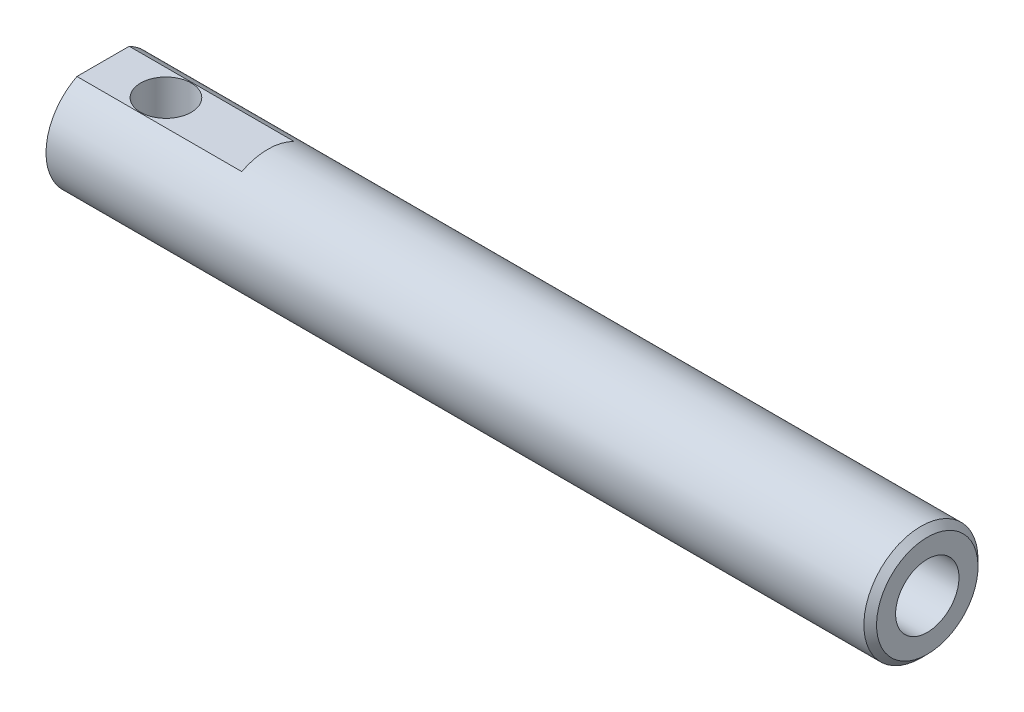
ISO-10303-21;
HEADER;
FILE_DESCRIPTION(('STEP AP214'),'2;1');
FILE_NAME('part.step','',(''),(''),'','','');
FILE_SCHEMA(('AUTOMOTIVE_DESIGN { 1 0 10303 214 1 1 1 1 }'));
ENDSEC;
DATA;
#1=APPLICATION_CONTEXT('core data for automotive mechanical design processes');
#2=APPLICATION_PROTOCOL_DEFINITION('international standard','automotive_design',2000,#1);
#3=PRODUCT_CONTEXT('',#1,'mechanical');
#4=PRODUCT('Part','Part','',(#3));
#5=PRODUCT_RELATED_PRODUCT_CATEGORY('part','',(#4));
#6=PRODUCT_DEFINITION_FORMATION('','',#4);
#7=PRODUCT_DEFINITION_CONTEXT('part definition',#1,'design');
#8=PRODUCT_DEFINITION('design','',#6,#7);
#9=PRODUCT_DEFINITION_SHAPE('','',#8);
#10=(LENGTH_UNIT() NAMED_UNIT(*) SI_UNIT(.MILLI.,.METRE.));
#11=(NAMED_UNIT(*) PLANE_ANGLE_UNIT() SI_UNIT($,.RADIAN.));
#12=(NAMED_UNIT(*) SI_UNIT($,.STERADIAN.) SOLID_ANGLE_UNIT());
#13=UNCERTAINTY_MEASURE_WITH_UNIT(LENGTH_MEASURE(1.E-05),#10,'distance_accuracy_value','');
#14=(GEOMETRIC_REPRESENTATION_CONTEXT(3) GLOBAL_UNCERTAINTY_ASSIGNED_CONTEXT((#13)) GLOBAL_UNIT_ASSIGNED_CONTEXT((#10,
#11,#12)) REPRESENTATION_CONTEXT('',''));
#15=CARTESIAN_POINT('',(0.,0.,0.));
#16=DIRECTION('',(0.,0.,1.));
#17=DIRECTION('',(1.,0.,0.));
#18=AXIS2_PLACEMENT_3D('',#15,#16,#17);
#19=CARTESIAN_POINT('',(60.04,-4.92856329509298E-13,-2.84550734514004E-13));
#20=DIRECTION('',(1.,0.,0.));
#21=DIRECTION('',(0.,1.,0.));
#22=AXIS2_PLACEMENT_3D('',#19,#20,#21);
#23=PLANE('',#22);
#24=CARTESIAN_POINT('',(60.04,0.,-0.00155281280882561));
#25=DIRECTION('',(1.,0.,0.));
#26=DIRECTION('',(0.,1.,0.));
#27=AXIS2_PLACEMENT_3D('',#24,#25,#26);
#28=CIRCLE('',#27,2.5);
#29=CARTESIAN_POINT('',(60.04,2.5,-0.00155281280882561));
#30=VERTEX_POINT('',#29);
#31=EDGE_CURVE('E122',#30,#30,#28,.F.);
#32=ORIENTED_EDGE('',*,*,#31,.T.);
#33=EDGE_LOOP('',(#32));
#34=FACE_BOUND('',#33,.T.);
#35=CARTESIAN_POINT('',(60.04,0.,-0.00155281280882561));
#36=DIRECTION('',(-1.,0.,0.));
#37=DIRECTION('',(0.,-1.,0.));
#38=AXIS2_PLACEMENT_3D('',#35,#36,#37);
#39=CIRCLE('',#38,4.);
#40=CARTESIAN_POINT('',(60.04,-4.,-0.00155281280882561));
#41=VERTEX_POINT('',#40);
#42=EDGE_CURVE('E21',#41,#41,#39,.T.);
#43=ORIENTED_EDGE('',*,*,#42,.F.);
#44=EDGE_LOOP('',(#43));
#45=FACE_BOUND('',#44,.T.);
#46=ADVANCED_FACE('F17',(#34,#45),#23,.T.);
#47=CARTESIAN_POINT('',(0.,-4.62230215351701,0.));
#48=DIRECTION('',(0.,1.,0.));
#49=DIRECTION('',(-1.,0.,0.));
#50=AXIS2_PLACEMENT_3D('',#47,#48,#49);
#51=CYLINDRICAL_SURFACE('',#50,2.);
#52=CARTESIAN_POINT('',(0.,4.,0.));
#53=DIRECTION('',(0.,1.,0.));
#54=DIRECTION('',(-1.,0.,0.));
#55=AXIS2_PLACEMENT_3D('',#52,#53,#54);
#56=CIRCLE('',#55,2.);
#57=CARTESIAN_POINT('',(-2.,4.,0.));
#58=VERTEX_POINT('',#57);
#59=EDGE_CURVE('E11',#58,#58,#56,.T.);
#60=ORIENTED_EDGE('',*,*,#59,.T.);
#61=EDGE_LOOP('',(#60));
#62=FACE_BOUND('',#61,.T.);
#63=CARTESIAN_POINT('',(0.,-4.,0.));
#64=DIRECTION('',(0.,1.,0.));
#65=DIRECTION('',(0.,0.,1.));
#66=AXIS2_PLACEMENT_3D('',#63,#64,#65);
#67=CIRCLE('',#66,2.);
#68=CARTESIAN_POINT('',(0.,-4.,2.));
#69=VERTEX_POINT('',#68);
#70=EDGE_CURVE('E27',#69,#69,#67,.F.);
#71=ORIENTED_EDGE('',*,*,#70,.T.);
#72=EDGE_LOOP('',(#71));
#73=FACE_BOUND('',#72,.T.);
#74=ADVANCED_FACE('F135',(#62,#73),#51,.F.);
#75=CARTESIAN_POINT('',(8.04,7.,11.8113352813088));
#76=DIRECTION('',(-1.,0.,0.));
#77=DIRECTION('',(0.,-1.,0.));
#78=AXIS2_PLACEMENT_3D('',#75,#76,#77);
#79=PLANE('',#78);
#80=CARTESIAN_POINT('',(8.04,0.,-0.00155281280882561));
#81=DIRECTION('',(-1.,0.,0.));
#82=DIRECTION('',(0.,-1.,0.));
#83=AXIS2_PLACEMENT_3D('',#80,#81,#82);
#84=CIRCLE('',#83,4.5);
#85=CARTESIAN_POINT('',(8.04,4.,2.06));
#86=VERTEX_POINT('',#85);
#87=CARTESIAN_POINT('',(8.04,4.,-2.06310562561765));
#88=VERTEX_POINT('',#87);
#89=EDGE_CURVE('E41',#86,#88,#84,.T.);
#90=ORIENTED_EDGE('',*,*,#89,.T.);
#91=DIRECTION('',(0.,0.,1.));
#92=VECTOR('',#91,1.);
#93=CARTESIAN_POINT('',(8.04,4.,11.8113352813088));
#94=LINE('',#93,#92);
#95=EDGE_CURVE('E97',#88,#86,#94,.T.);
#96=ORIENTED_EDGE('',*,*,#95,.T.);
#97=EDGE_LOOP('',(#90,#96));
#98=FACE_BOUND('',#97,.T.);
#99=ADVANCED_FACE('F142',(#98),#79,.T.);
#100=CARTESIAN_POINT('',(8.04,4.,11.8113352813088));
#101=DIRECTION('',(0.,-1.,0.));
#102=DIRECTION('',(0.,0.,1.));
#103=AXIS2_PLACEMENT_3D('',#100,#101,#102);
#104=PLANE('',#103);
#105=ORIENTED_EDGE('',*,*,#59,.F.);
#106=EDGE_LOOP('',(#105));
#107=FACE_BOUND('',#106,.T.);
#108=DIRECTION('',(0.,0.,1.));
#109=VECTOR('',#108,1.);
#110=CARTESIAN_POINT('',(-4.96,4.,-0.00155281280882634));
#111=LINE('',#110,#109);
#112=CARTESIAN_POINT('',(-4.96,4.,-2.06310562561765));
#113=VERTEX_POINT('',#112);
#114=CARTESIAN_POINT('',(-4.96,4.,2.06));
#115=VERTEX_POINT('',#114);
#116=EDGE_CURVE('E76',#113,#115,#111,.T.);
#117=ORIENTED_EDGE('',*,*,#116,.T.);
#118=DIRECTION('',(-1.,0.,0.));
#119=VECTOR('',#118,1.);
#120=CARTESIAN_POINT('',(-4.96,4.,2.06));
#121=LINE('',#120,#119);
#122=EDGE_CURVE('E84',#86,#115,#121,.T.);
#123=ORIENTED_EDGE('',*,*,#122,.F.);
#124=ORIENTED_EDGE('',*,*,#95,.F.);
#125=DIRECTION('',(1.,0.,0.));
#126=VECTOR('',#125,1.);
#127=CARTESIAN_POINT('',(-4.96,4.,-2.06310562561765));
#128=LINE('',#127,#126);
#129=EDGE_CURVE('E94',#113,#88,#128,.T.);
#130=ORIENTED_EDGE('',*,*,#129,.F.);
#131=EDGE_LOOP('',(#117,#123,#124,#130));
#132=FACE_BOUND('',#131,.T.);
#133=ADVANCED_FACE('F93',(#107,#132),#104,.F.);
#134=CARTESIAN_POINT('',(-4.96,0.,-0.00155281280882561));
#135=DIRECTION('',(-1.,0.,0.));
#136=DIRECTION('',(0.,-1.,0.));
#137=AXIS2_PLACEMENT_3D('',#134,#135,#136);
#138=PLANE('',#137);
#139=ORIENTED_EDGE('',*,*,#116,.F.);
#140=CARTESIAN_POINT('',(-4.96,0.,-0.00155281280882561));
#141=DIRECTION('',(-1.,0.,0.));
#142=DIRECTION('',(0.,-1.,0.));
#143=AXIS2_PLACEMENT_3D('',#140,#141,#142);
#144=CIRCLE('',#143,4.5);
#145=CARTESIAN_POINT('',(-4.96,-4.,-2.06310562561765));
#146=VERTEX_POINT('',#145);
#147=EDGE_CURVE('E81',#113,#146,#144,.T.);
#148=ORIENTED_EDGE('',*,*,#147,.T.);
#149=DIRECTION('',(0.,0.,-1.));
#150=VECTOR('',#149,1.);
#151=CARTESIAN_POINT('',(-4.96,-4.,-0.00155281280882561));
#152=LINE('',#151,#150);
#153=CARTESIAN_POINT('',(-4.96,-4.,2.06));
#154=VERTEX_POINT('',#153);
#155=EDGE_CURVE('E78',#154,#146,#152,.T.);
#156=ORIENTED_EDGE('',*,*,#155,.F.);
#157=CARTESIAN_POINT('',(-4.96,0.,-0.00155281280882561));
#158=DIRECTION('',(-1.,0.,0.));
#159=DIRECTION('',(0.,-1.,0.));
#160=AXIS2_PLACEMENT_3D('',#157,#158,#159);
#161=CIRCLE('',#160,4.5);
#162=EDGE_CURVE('E66',#154,#115,#161,.T.);
#163=ORIENTED_EDGE('',*,*,#162,.T.);
#164=EDGE_LOOP('',(#139,#148,#156,#163));
#165=FACE_BOUND('',#164,.T.);
#166=ADVANCED_FACE('F73',(#165),#138,.T.);
#167=CARTESIAN_POINT('',(8.04,-7.,11.8113352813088));
#168=DIRECTION('',(-1.,0.,0.));
#169=DIRECTION('',(0.,-1.,0.));
#170=AXIS2_PLACEMENT_3D('',#167,#168,#169);
#171=PLANE('',#170);
#172=CARTESIAN_POINT('',(8.04,0.,-0.00155281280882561));
#173=DIRECTION('',(-1.,0.,0.));
#174=DIRECTION('',(0.,-1.,0.));
#175=AXIS2_PLACEMENT_3D('',#172,#173,#174);
#176=CIRCLE('',#175,4.5);
#177=CARTESIAN_POINT('',(8.04,-4.,-2.06310562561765));
#178=VERTEX_POINT('',#177);
#179=CARTESIAN_POINT('',(8.04,-4.,2.06));
#180=VERTEX_POINT('',#179);
#181=EDGE_CURVE('E80',#178,#180,#176,.T.);
#182=ORIENTED_EDGE('',*,*,#181,.T.);
#183=DIRECTION('',(0.,0.,-1.));
#184=VECTOR('',#183,1.);
#185=CARTESIAN_POINT('',(8.04,-4.,11.8113352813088));
#186=LINE('',#185,#184);
#187=EDGE_CURVE('E108',#180,#178,#186,.T.);
#188=ORIENTED_EDGE('',*,*,#187,.T.);
#189=EDGE_LOOP('',(#182,#188));
#190=FACE_BOUND('',#189,.T.);
#191=ADVANCED_FACE('F163',(#190),#171,.T.);
#192=CARTESIAN_POINT('',(8.04,-4.,11.8113352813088));
#193=DIRECTION('',(0.,1.,0.));
#194=DIRECTION('',(-1.,0.,0.));
#195=AXIS2_PLACEMENT_3D('',#192,#193,#194);
#196=PLANE('',#195);
#197=ORIENTED_EDGE('',*,*,#70,.F.);
#198=EDGE_LOOP('',(#197));
#199=FACE_BOUND('',#198,.T.);
#200=ORIENTED_EDGE('',*,*,#155,.T.);
#201=DIRECTION('',(-1.,0.,0.));
#202=VECTOR('',#201,1.);
#203=CARTESIAN_POINT('',(-4.96,-4.,-2.06310562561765));
#204=LINE('',#203,#202);
#205=EDGE_CURVE('E113',#178,#146,#204,.T.);
#206=ORIENTED_EDGE('',*,*,#205,.F.);
#207=ORIENTED_EDGE('',*,*,#187,.F.);
#208=DIRECTION('',(1.,0.,0.));
#209=VECTOR('',#208,1.);
#210=CARTESIAN_POINT('',(-4.96,-4.,2.06));
#211=LINE('',#210,#209);
#212=EDGE_CURVE('E89',#154,#180,#211,.T.);
#213=ORIENTED_EDGE('',*,*,#212,.F.);
#214=EDGE_LOOP('',(#200,#206,#207,#213));
#215=FACE_BOUND('',#214,.T.);
#216=ADVANCED_FACE('F159',(#199,#215),#196,.F.);
#217=CARTESIAN_POINT('',(-4.96,0.,-0.00155281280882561));
#218=DIRECTION('',(1.,0.,0.));
#219=DIRECTION('',(0.,1.,0.));
#220=AXIS2_PLACEMENT_3D('',#217,#218,#219);
#221=CYLINDRICAL_SURFACE('',#220,4.5);
#222=CARTESIAN_POINT('',(59.54,0.,-0.00155281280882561));
#223=DIRECTION('',(-1.,0.,0.));
#224=DIRECTION('',(0.,-1.,0.));
#225=AXIS2_PLACEMENT_3D('',#222,#223,#224);
#226=CIRCLE('',#225,4.5);
#227=CARTESIAN_POINT('',(59.54,-4.5,-0.00155281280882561));
#228=VERTEX_POINT('',#227);
#229=EDGE_CURVE('E90',#228,#228,#226,.T.);
#230=ORIENTED_EDGE('',*,*,#229,.T.);
#231=EDGE_LOOP('',(#230));
#232=FACE_BOUND('',#231,.T.);
#233=ORIENTED_EDGE('',*,*,#212,.T.);
#234=ORIENTED_EDGE('',*,*,#181,.F.);
#235=ORIENTED_EDGE('',*,*,#205,.T.);
#236=ORIENTED_EDGE('',*,*,#147,.F.);
#237=ORIENTED_EDGE('',*,*,#129,.T.);
#238=ORIENTED_EDGE('',*,*,#89,.F.);
#239=ORIENTED_EDGE('',*,*,#122,.T.);
#240=ORIENTED_EDGE('',*,*,#162,.F.);
#241=EDGE_LOOP('',(#233,#234,#235,#236,#237,#238,#239,#240));
#242=FACE_BOUND('',#241,.T.);
#243=ADVANCED_FACE('F85',(#232,#242),#221,.T.);
#244=CARTESIAN_POINT('',(59.54,0.,-0.00155281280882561));
#245=DIRECTION('',(-1.,0.,0.));
#246=DIRECTION('',(0.,-1.,0.));
#247=AXIS2_PLACEMENT_3D('',#244,#245,#246);
#248=CONICAL_SURFACE('',#247,4.5,0.785398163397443);
#249=ORIENTED_EDGE('',*,*,#229,.F.);
#250=EDGE_LOOP('',(#249));
#251=FACE_BOUND('',#250,.T.);
#252=ORIENTED_EDGE('',*,*,#42,.T.);
#253=EDGE_LOOP('',(#252));
#254=FACE_BOUND('',#253,.T.);
#255=ADVANCED_FACE('F132',(#251,#254),#248,.T.);
#256=CARTESIAN_POINT('',(60.04,0.,-0.00155281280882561));
#257=DIRECTION('',(1.,0.,0.));
#258=DIRECTION('',(0.,1.,0.));
#259=AXIS2_PLACEMENT_3D('',#256,#257,#258);
#260=CYLINDRICAL_SURFACE('',#259,2.5);
#261=CARTESIAN_POINT('',(40.04,0.,-0.00155281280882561));
#262=DIRECTION('',(1.,0.,0.));
#263=DIRECTION('',(0.,1.,0.));
#264=AXIS2_PLACEMENT_3D('',#261,#262,#263);
#265=CIRCLE('',#264,2.5);
#266=CARTESIAN_POINT('',(40.04,2.5,-0.00155281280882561));
#267=VERTEX_POINT('',#266);
#268=EDGE_CURVE('E96',#267,#267,#265,.T.);
#269=ORIENTED_EDGE('',*,*,#268,.F.);
#270=EDGE_LOOP('',(#269));
#271=FACE_BOUND('',#270,.T.);
#272=ORIENTED_EDGE('',*,*,#31,.F.);
#273=EDGE_LOOP('',(#272));
#274=FACE_BOUND('',#273,.T.);
#275=ADVANCED_FACE('F19',(#271,#274),#260,.F.);
#276=CARTESIAN_POINT('',(40.04,0.,-0.00155281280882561));
#277=DIRECTION('',(1.,0.,0.));
#278=DIRECTION('',(0.,1.,0.));
#279=AXIS2_PLACEMENT_3D('',#276,#277,#278);
#280=PLANE('',#279);
#281=ORIENTED_EDGE('',*,*,#268,.T.);
#282=EDGE_LOOP('',(#281));
#283=FACE_BOUND('',#282,.T.);
#284=ADVANCED_FACE('F136',(#283),#280,.T.);
#285=CLOSED_SHELL('',(#46,#74,#99,#133,#166,#191,#216,#243,#255,#275,#284));
#286=MANIFOLD_SOLID_BREP('B1',#285);
#287=ADVANCED_BREP_SHAPE_REPRESENTATION('',(#18,#286),#14);
#288=SHAPE_DEFINITION_REPRESENTATION(#9,#287);
ENDSEC;
END-ISO-10303-21;
